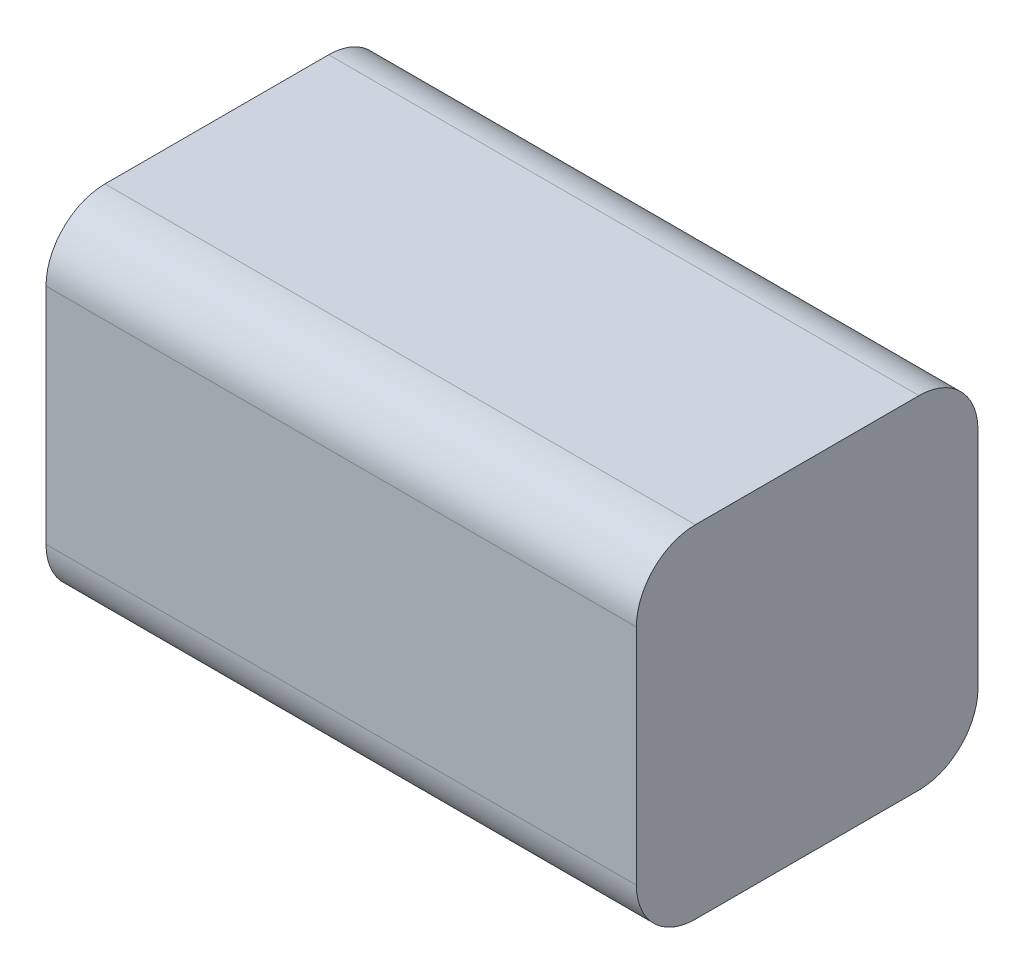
from build123d import *

# Parameters (mm, degrees)
SKETCH1_W           = 50.038
SKETCH1_H           = 28.956
BOSS_EXTRUDE1_DEPTH = 28.956
FILLET1_R           = 5


with BuildPart() as part:
    # Sketch1 → Boss-Extrude1 (new body)
    with BuildSketch(Plane(origin=(0, 0, 0), x_dir=(1, 0, 0), z_dir=(0, 1, 0))):
        with Locations((-25.019, -14.478)):
            Rectangle(SKETCH1_W, SKETCH1_H)
    extrude(amount=BOSS_EXTRUDE1_DEPTH)

    # Fillet1
    fillet1_edges = [part.edges().sort_by_distance(p)[0] for p in [
        (-25.019, 28.956, 28.956),
        (-25.019, 0, 28.956),
        (-25.019, 0, 0),
        (-25.019, 28.956, 0),
    ]]
    fillet(fillet1_edges, radius=FILLET1_R)


solid = part.part
